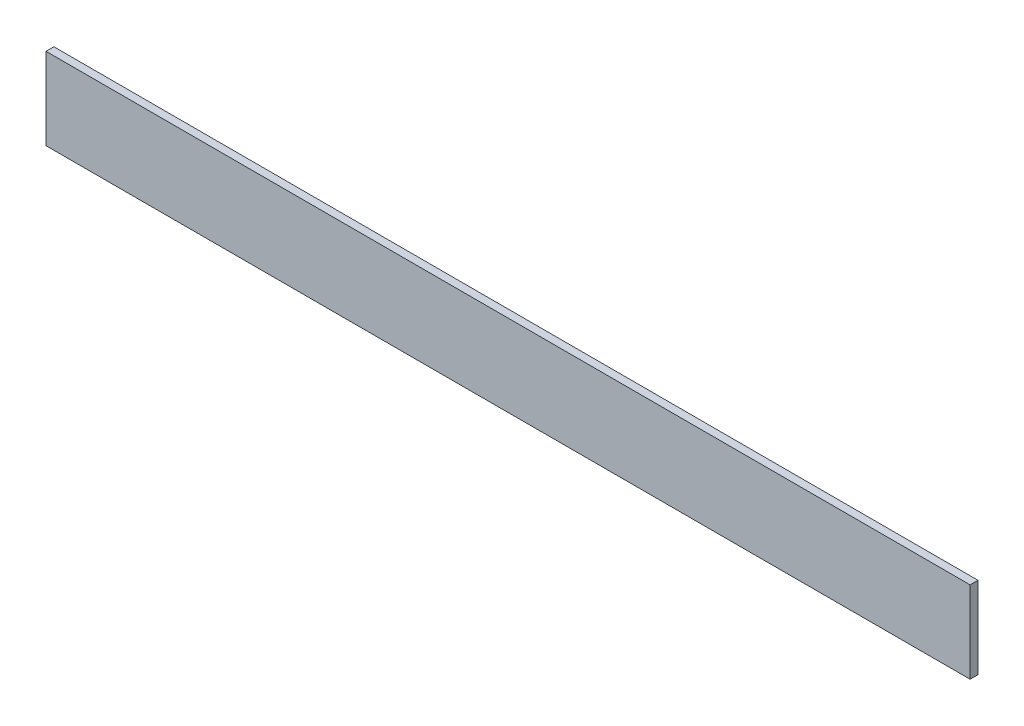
from build123d import *

# Parameters (mm, degrees)
ESQUISSE1_W      = 938
ESQUISSE1_H      = 83
EXTRUSION1_DEPTH = 8


with BuildPart() as part:
    # Esquisse1 → Extrusion1 (new body)
    with BuildSketch(Plane.XY):
        with Locations((469, 41.5)):
            Rectangle(ESQUISSE1_W, ESQUISSE1_H)
    extrude(amount=-EXTRUSION1_DEPTH)


solid = part.part
